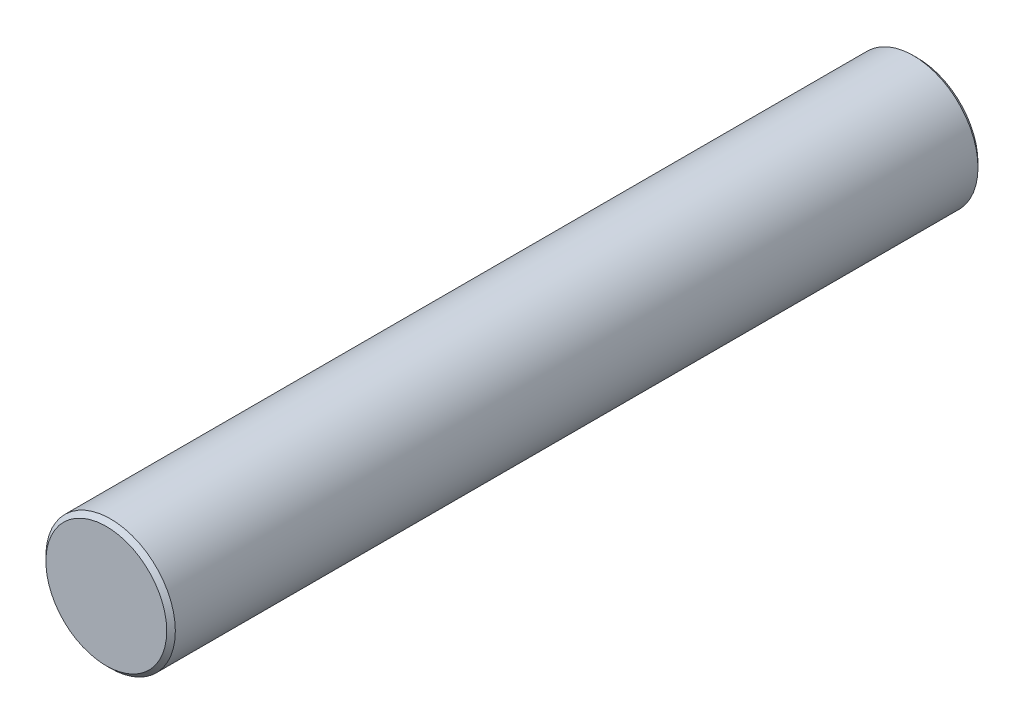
ISO-10303-21;
HEADER;
FILE_DESCRIPTION(('STEP AP214'),'2;1');
FILE_NAME('part.step','',(''),(''),'','','');
FILE_SCHEMA(('AUTOMOTIVE_DESIGN { 1 0 10303 214 1 1 1 1 }'));
ENDSEC;
DATA;
#1=APPLICATION_CONTEXT('core data for automotive mechanical design processes');
#2=APPLICATION_PROTOCOL_DEFINITION('international standard','automotive_design',2000,#1);
#3=PRODUCT_CONTEXT('',#1,'mechanical');
#4=PRODUCT('Part','Part','',(#3));
#5=PRODUCT_RELATED_PRODUCT_CATEGORY('part','',(#4));
#6=PRODUCT_DEFINITION_FORMATION('','',#4);
#7=PRODUCT_DEFINITION_CONTEXT('part definition',#1,'design');
#8=PRODUCT_DEFINITION('design','',#6,#7);
#9=PRODUCT_DEFINITION_SHAPE('','',#8);
#10=(LENGTH_UNIT() NAMED_UNIT(*) SI_UNIT(.MILLI.,.METRE.));
#11=(NAMED_UNIT(*) PLANE_ANGLE_UNIT() SI_UNIT($,.RADIAN.));
#12=(NAMED_UNIT(*) SI_UNIT($,.STERADIAN.) SOLID_ANGLE_UNIT());
#13=UNCERTAINTY_MEASURE_WITH_UNIT(LENGTH_MEASURE(1.E-05),#10,'distance_accuracy_value','');
#14=(GEOMETRIC_REPRESENTATION_CONTEXT(3) GLOBAL_UNCERTAINTY_ASSIGNED_CONTEXT((#13)) GLOBAL_UNIT_ASSIGNED_CONTEXT((#10,
#11,#12)) REPRESENTATION_CONTEXT('',''));
#15=CARTESIAN_POINT('',(0.,0.,0.));
#16=DIRECTION('',(0.,0.,1.));
#17=DIRECTION('',(1.,0.,0.));
#18=AXIS2_PLACEMENT_3D('',#15,#16,#17);
#19=CARTESIAN_POINT('',(0.,0.,37.6));
#20=DIRECTION('',(0.,0.,-1.));
#21=DIRECTION('',(-1.,0.,0.));
#22=AXIS2_PLACEMENT_3D('',#19,#20,#21);
#23=CYLINDRICAL_SURFACE('',#22,3.);
#24=CARTESIAN_POINT('',(0.,0.,37.4));
#25=DIRECTION('',(0.,0.,1.));
#26=DIRECTION('',(1.,0.,0.));
#27=AXIS2_PLACEMENT_3D('',#24,#25,#26);
#28=CIRCLE('',#27,3.);
#29=CARTESIAN_POINT('',(3.,0.,37.4));
#30=VERTEX_POINT('',#29);
#31=EDGE_CURVE('E44',#30,#30,#28,.F.);
#32=ORIENTED_EDGE('',*,*,#31,.T.);
#33=EDGE_LOOP('',(#32));
#34=FACE_BOUND('',#33,.T.);
#35=CARTESIAN_POINT('',(0.,0.,0.199999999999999));
#36=DIRECTION('',(0.,0.,1.));
#37=DIRECTION('',(1.,0.,0.));
#38=AXIS2_PLACEMENT_3D('',#35,#36,#37);
#39=CIRCLE('',#38,3.);
#40=CARTESIAN_POINT('',(3.,0.,0.199999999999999));
#41=VERTEX_POINT('',#40);
#42=EDGE_CURVE('E61',#41,#41,#39,.T.);
#43=ORIENTED_EDGE('',*,*,#42,.T.);
#44=EDGE_LOOP('',(#43));
#45=FACE_BOUND('',#44,.T.);
#46=ADVANCED_FACE('F37',(#34,#45),#23,.T.);
#47=CARTESIAN_POINT('',(0.,0.,37.6));
#48=DIRECTION('',(0.,0.,1.));
#49=DIRECTION('',(1.,0.,0.));
#50=AXIS2_PLACEMENT_3D('',#47,#48,#49);
#51=PLANE('',#50);
#52=CARTESIAN_POINT('',(0.,0.,37.6));
#53=DIRECTION('',(0.,0.,1.));
#54=DIRECTION('',(1.,0.,0.));
#55=AXIS2_PLACEMENT_3D('',#52,#53,#54);
#56=CIRCLE('',#55,2.80000000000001);
#57=CARTESIAN_POINT('',(2.80000000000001,0.,37.6));
#58=VERTEX_POINT('',#57);
#59=EDGE_CURVE('E57',#58,#58,#56,.T.);
#60=ORIENTED_EDGE('',*,*,#59,.T.);
#61=EDGE_LOOP('',(#60));
#62=FACE_BOUND('',#61,.T.);
#63=ADVANCED_FACE('F77',(#62),#51,.T.);
#64=CARTESIAN_POINT('',(0.,0.,0.));
#65=DIRECTION('',(0.,0.,1.));
#66=DIRECTION('',(1.,0.,0.));
#67=AXIS2_PLACEMENT_3D('',#64,#65,#66);
#68=PLANE('',#67);
#69=CARTESIAN_POINT('',(0.,0.,0.));
#70=DIRECTION('',(0.,0.,1.));
#71=DIRECTION('',(1.,0.,0.));
#72=AXIS2_PLACEMENT_3D('',#69,#70,#71);
#73=CIRCLE('',#72,2.8);
#74=CARTESIAN_POINT('',(2.8,0.,0.));
#75=VERTEX_POINT('',#74);
#76=EDGE_CURVE('E11',#75,#75,#73,.F.);
#77=ORIENTED_EDGE('',*,*,#76,.T.);
#78=EDGE_LOOP('',(#77));
#79=FACE_BOUND('',#78,.T.);
#80=CARTESIAN_POINT('',(0.,0.,0.));
#81=DIRECTION('',(0.,0.,-1.));
#82=DIRECTION('',(-1.,0.,0.));
#83=AXIS2_PLACEMENT_3D('',#80,#81,#82);
#84=CIRCLE('',#83,1.24999999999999);
#85=CARTESIAN_POINT('',(-1.24999999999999,0.,0.));
#86=VERTEX_POINT('',#85);
#87=EDGE_CURVE('E58',#86,#86,#84,.T.);
#88=ORIENTED_EDGE('',*,*,#87,.F.);
#89=EDGE_LOOP('',(#88));
#90=FACE_BOUND('',#89,.T.);
#91=ADVANCED_FACE('F51',(#79,#90),#68,.F.);
#92=CARTESIAN_POINT('',(0.,0.,7.5));
#93=DIRECTION('',(0.,0.,-1.));
#94=DIRECTION('',(-1.,0.,0.));
#95=AXIS2_PLACEMENT_3D('',#92,#93,#94);
#96=CONICAL_SURFACE('',#95,1.25,1.02974425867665);
#97=CARTESIAN_POINT('',(0.,0.,8.25107577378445));
#98=VERTEX_POINT('',#97);
#99=VERTEX_LOOP('',#98);
#100=FACE_BOUND('',#99,.T.);
#101=CARTESIAN_POINT('',(0.,0.,7.5));
#102=DIRECTION('',(0.,0.,-1.));
#103=DIRECTION('',(-1.,0.,0.));
#104=AXIS2_PLACEMENT_3D('',#101,#102,#103);
#105=CIRCLE('',#104,1.25);
#106=CARTESIAN_POINT('',(-1.25,0.,7.5));
#107=VERTEX_POINT('',#106);
#108=EDGE_CURVE('E55',#107,#107,#105,.T.);
#109=ORIENTED_EDGE('',*,*,#108,.T.);
#110=EDGE_LOOP('',(#109));
#111=FACE_BOUND('',#110,.T.);
#112=ADVANCED_FACE('F47',(#100,#111),#96,.F.);
#113=CARTESIAN_POINT('',(0.,0.,0.));
#114=DIRECTION('',(0.,0.,-1.));
#115=DIRECTION('',(-1.,0.,0.));
#116=AXIS2_PLACEMENT_3D('',#113,#114,#115);
#117=CYLINDRICAL_SURFACE('',#116,1.24999999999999);
#118=ORIENTED_EDGE('',*,*,#108,.F.);
#119=EDGE_LOOP('',(#118));
#120=FACE_BOUND('',#119,.T.);
#121=ORIENTED_EDGE('',*,*,#87,.T.);
#122=EDGE_LOOP('',(#121));
#123=FACE_BOUND('',#122,.T.);
#124=ADVANCED_FACE('F50',(#120,#123),#117,.F.);
#125=CARTESIAN_POINT('',(0.,0.,37.6));
#126=DIRECTION('',(0.,0.,-1.));
#127=DIRECTION('',(-1.,0.,0.));
#128=AXIS2_PLACEMENT_3D('',#125,#126,#127);
#129=CONICAL_SURFACE('',#128,2.80000000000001,0.785398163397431);
#130=ORIENTED_EDGE('',*,*,#31,.F.);
#131=EDGE_LOOP('',(#130));
#132=FACE_BOUND('',#131,.T.);
#133=ORIENTED_EDGE('',*,*,#59,.F.);
#134=EDGE_LOOP('',(#133));
#135=FACE_BOUND('',#134,.T.);
#136=ADVANCED_FACE('F72',(#132,#135),#129,.T.);
#137=CARTESIAN_POINT('',(0.,0.,0.199999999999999));
#138=DIRECTION('',(0.,0.,1.));
#139=DIRECTION('',(1.,0.,0.));
#140=AXIS2_PLACEMENT_3D('',#137,#138,#139);
#141=CONICAL_SURFACE('',#140,3.,0.785398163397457);
#142=ORIENTED_EDGE('',*,*,#76,.F.);
#143=EDGE_LOOP('',(#142));
#144=FACE_BOUND('',#143,.T.);
#145=ORIENTED_EDGE('',*,*,#42,.F.);
#146=EDGE_LOOP('',(#145));
#147=FACE_BOUND('',#146,.T.);
#148=ADVANCED_FACE('F39',(#144,#147),#141,.T.);
#149=CLOSED_SHELL('',(#46,#63,#91,#112,#124,#136,#148));
#150=MANIFOLD_SOLID_BREP('B2',#149);
#151=ADVANCED_BREP_SHAPE_REPRESENTATION('',(#18,#150),#14);
#152=SHAPE_DEFINITION_REPRESENTATION(#9,#151);
ENDSEC;
END-ISO-10303-21;
